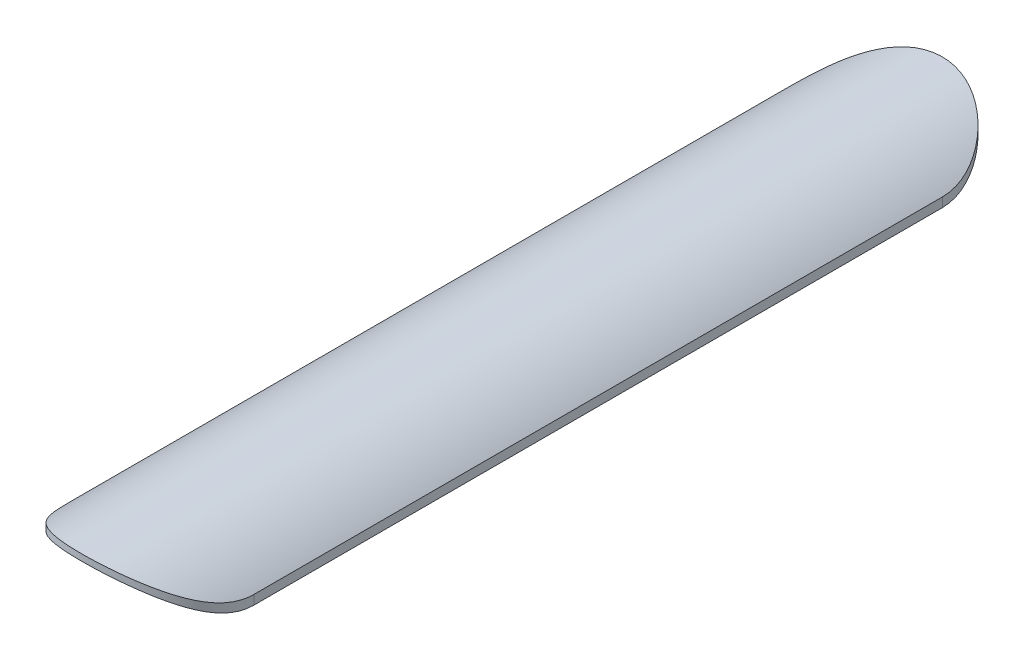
from build123d import *

# Parameters (mm, degrees)
PORTION_CYLINDRIQUE_DEPTH         = 210
D_COUPAGE_CONTOUR_SURFACE_1_BACK  = 439.913
D_COUPAGE_CONTOUR_SURFACE_1_DEPTH = 879.826


with BuildPart() as part:
    # Esquisse1 → portion cylindrique (new, symmetric)
    with BuildSketch(Plane.XY):
        with BuildLine():
            ThreePointArc((-57, 0), (0, 57), (57, 0))
            Line((57, 0), (54, 0))
            ThreePointArc((54, 0), (0, 54), (-54, 0))
            Line((-54, 0), (-57, 0))
        make_face()
    extrude(amount=PORTION_CYLINDRIQUE_DEPTH, both=True)

    # d_coupage contour: cut with a surface, the side behind it stays
    # d_coupage contour surface: a surface, the sketch's curves swept straight by 879.826 mm
    with BuildLine(Plane(origin=(0, 0, 0), x_dir=(1, 0, 0), z_dir=(0, 1, 0)).offset(-D_COUPAGE_CONTOUR_SURFACE_1_BACK), mode=Mode.PRIVATE) as d_coupage_contour_surface_1_path:
        Line((40, 160), (40, -160))
        ThreePointArc((40, -160), (0, -200), (-40, -160))
        Line((-40, -160), (-40, 160))
        ThreePointArc((-40, 160), (0, 200), (40, 160))
    d_coupage_contour_surface_1 = Shell.extrude(d_coupage_contour_surface_1_path.wire(), (0 * D_COUPAGE_CONTOUR_SURFACE_1_DEPTH, 1 * D_COUPAGE_CONTOUR_SURFACE_1_DEPTH, 0 * D_COUPAGE_CONTOUR_SURFACE_1_DEPTH))
    split(bisect_by=d_coupage_contour_surface_1, keep=Keep.BOTTOM)


solid = part.part
